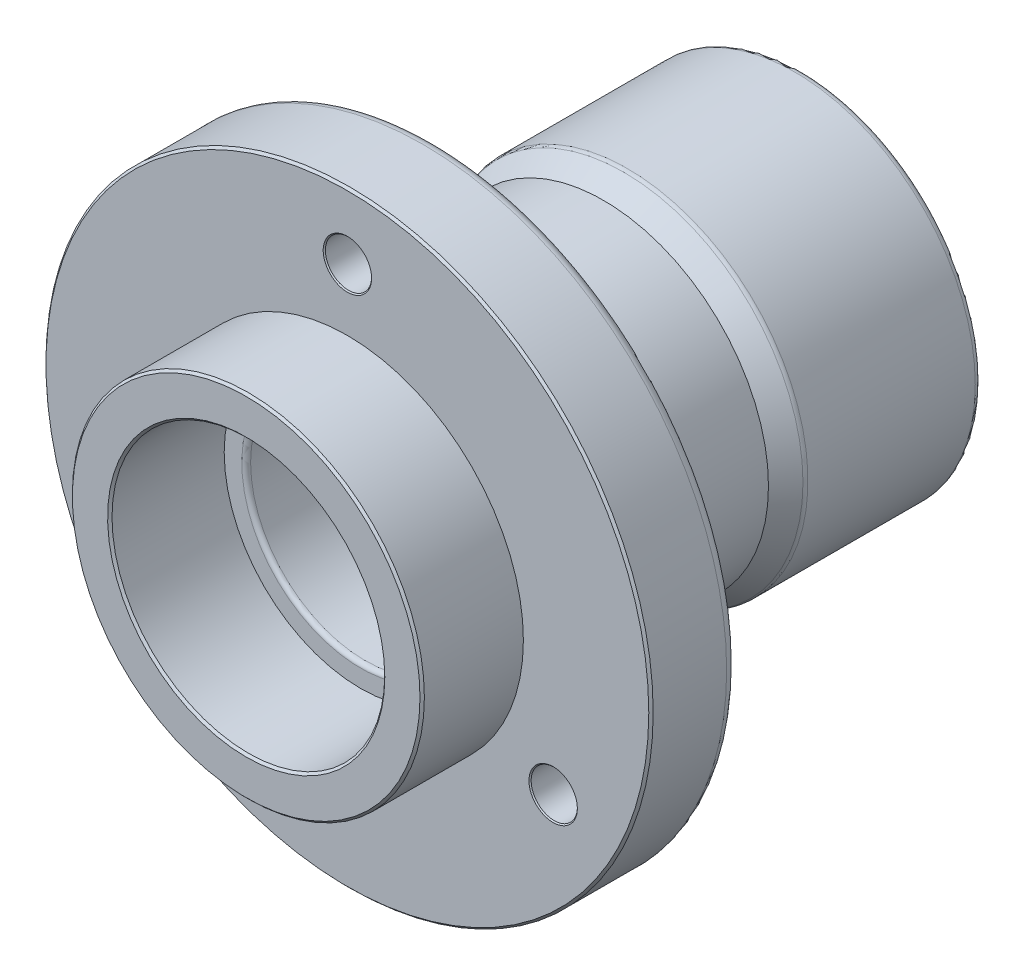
ISO-10303-21;
HEADER;
FILE_DESCRIPTION(('STEP AP214'),'2;1');
FILE_NAME('part.step','',(''),(''),'','','');
FILE_SCHEMA(('AUTOMOTIVE_DESIGN { 1 0 10303 214 1 1 1 1 }'));
ENDSEC;
DATA;
#1=APPLICATION_CONTEXT('core data for automotive mechanical design processes');
#2=APPLICATION_PROTOCOL_DEFINITION('international standard','automotive_design',2000,#1);
#3=PRODUCT_CONTEXT('',#1,'mechanical');
#4=PRODUCT('Part','Part','',(#3));
#5=PRODUCT_RELATED_PRODUCT_CATEGORY('part','',(#4));
#6=PRODUCT_DEFINITION_FORMATION('','',#4);
#7=PRODUCT_DEFINITION_CONTEXT('part definition',#1,'design');
#8=PRODUCT_DEFINITION('design','',#6,#7);
#9=PRODUCT_DEFINITION_SHAPE('','',#8);
#10=(LENGTH_UNIT() NAMED_UNIT(*) SI_UNIT(.MILLI.,.METRE.));
#11=(NAMED_UNIT(*) PLANE_ANGLE_UNIT() SI_UNIT($,.RADIAN.));
#12=(NAMED_UNIT(*) SI_UNIT($,.STERADIAN.) SOLID_ANGLE_UNIT());
#13=UNCERTAINTY_MEASURE_WITH_UNIT(LENGTH_MEASURE(1.E-05),#10,'distance_accuracy_value','');
#14=(GEOMETRIC_REPRESENTATION_CONTEXT(3) GLOBAL_UNCERTAINTY_ASSIGNED_CONTEXT((#13)) GLOBAL_UNIT_ASSIGNED_CONTEXT((#10,
#11,#12)) REPRESENTATION_CONTEXT('',''));
#15=CARTESIAN_POINT('',(0.,0.,0.));
#16=DIRECTION('',(0.,0.,1.));
#17=DIRECTION('',(1.,0.,0.));
#18=AXIS2_PLACEMENT_3D('',#15,#16,#17);
#19=CARTESIAN_POINT('',(0.,0.,-26.1710302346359));
#20=DIRECTION('',(0.,0.,-1.));
#21=DIRECTION('',(0.,1.,0.));
#22=AXIS2_PLACEMENT_3D('',#19,#20,#21);
#23=CYLINDRICAL_SURFACE('',#22,31.);
#24=CARTESIAN_POINT('',(0.,0.,12.));
#25=DIRECTION('',(0.,0.,-1.));
#26=DIRECTION('',(0.,1.,0.));
#27=AXIS2_PLACEMENT_3D('',#24,#25,#26);
#28=CIRCLE('',#27,31.);
#29=CARTESIAN_POINT('',(0.,31.,12.));
#30=VERTEX_POINT('',#29);
#31=EDGE_CURVE('E66',#30,#30,#28,.T.);
#32=ORIENTED_EDGE('',*,*,#31,.F.);
#33=EDGE_LOOP('',(#32));
#34=FACE_BOUND('',#33,.T.);
#35=CARTESIAN_POINT('',(0.,0.,10.));
#36=DIRECTION('',(0.,0.,-1.));
#37=DIRECTION('',(-1.,0.,0.));
#38=AXIS2_PLACEMENT_3D('',#35,#36,#37);
#39=CIRCLE('',#38,31.);
#40=CARTESIAN_POINT('',(-31.,0.,10.));
#41=VERTEX_POINT('',#40);
#42=EDGE_CURVE('E63',#41,#41,#39,.F.);
#43=ORIENTED_EDGE('',*,*,#42,.F.);
#44=EDGE_LOOP('',(#43));
#45=FACE_BOUND('',#44,.T.);
#46=ADVANCED_FACE('F30',(#34,#45),#23,.F.);
#47=CARTESIAN_POINT('',(0.,0.,31.));
#48=DIRECTION('',(0.,0.,-1.));
#49=DIRECTION('',(0.,1.,0.));
#50=AXIS2_PLACEMENT_3D('',#47,#48,#49);
#51=CIRCLE('',#50,31.);
#52=CARTESIAN_POINT('',(0.,31.,31.));
#53=VERTEX_POINT('',#52);
#54=EDGE_CURVE('E151',#53,#53,#51,.T.);
#55=ORIENTED_EDGE('',*,*,#54,.F.);
#56=EDGE_LOOP('',(#55));
#57=FACE_BOUND('',#56,.T.);
#58=CARTESIAN_POINT('',(0.,0.,14.15));
#59=DIRECTION('',(0.,0.,-1.));
#60=DIRECTION('',(0.,1.,0.));
#61=AXIS2_PLACEMENT_3D('',#58,#59,#60);
#62=CIRCLE('',#61,31.);
#63=CARTESIAN_POINT('',(0.,31.,14.15));
#64=VERTEX_POINT('',#63);
#65=EDGE_CURVE('E154',#64,#64,#62,.T.);
#66=ORIENTED_EDGE('',*,*,#65,.T.);
#67=EDGE_LOOP('',(#66));
#68=FACE_BOUND('',#67,.T.);
#69=ADVANCED_FACE('F193',(#57,#68),#23,.F.);
#70=CARTESIAN_POINT('',(0.,0.,103.2));
#71=DIRECTION('',(0.,0.,1.));
#72=DIRECTION('',(1.,0.,0.));
#73=AXIS2_PLACEMENT_3D('',#70,#71,#72);
#74=PLANE('',#73);
#75=CARTESIAN_POINT('',(0.,0.,103.2));
#76=DIRECTION('',(0.,0.,1.));
#77=DIRECTION('',(1.,0.,0.));
#78=AXIS2_PLACEMENT_3D('',#75,#76,#77);
#79=CIRCLE('',#78,68.5);
#80=CARTESIAN_POINT('',(68.5,0.,103.2));
#81=VERTEX_POINT('',#80);
#82=EDGE_CURVE('E37',#81,#81,#79,.T.);
#83=ORIENTED_EDGE('',*,*,#82,.T.);
#84=EDGE_LOOP('',(#83));
#85=FACE_BOUND('',#84,.T.);
#86=CARTESIAN_POINT('',(-46.7653718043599,-26.9999999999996,103.2));
#87=DIRECTION('',(0.,0.,1.));
#88=DIRECTION('',(1.,0.,0.));
#89=AXIS2_PLACEMENT_3D('',#86,#87,#88);
#90=CIRCLE('',#89,5.50000000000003);
#91=CARTESIAN_POINT('',(-41.2653718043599,-26.9999999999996,103.2));
#92=VERTEX_POINT('',#91);
#93=EDGE_CURVE('E97',#92,#92,#90,.F.);
#94=ORIENTED_EDGE('',*,*,#93,.T.);
#95=EDGE_LOOP('',(#94));
#96=FACE_BOUND('',#95,.T.);
#97=CARTESIAN_POINT('',(46.7653718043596,-27.0000000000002,103.2));
#98=DIRECTION('',(0.,0.,1.));
#99=DIRECTION('',(1.,0.,0.));
#100=AXIS2_PLACEMENT_3D('',#97,#98,#99);
#101=CIRCLE('',#100,5.50000000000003);
#102=CARTESIAN_POINT('',(52.2653718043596,-27.0000000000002,103.2));
#103=VERTEX_POINT('',#102);
#104=EDGE_CURVE('E109',#103,#103,#101,.F.);
#105=ORIENTED_EDGE('',*,*,#104,.T.);
#106=EDGE_LOOP('',(#105));
#107=FACE_BOUND('',#106,.T.);
#108=CARTESIAN_POINT('',(0.,54.,103.2));
#109=DIRECTION('',(0.,0.,1.));
#110=DIRECTION('',(1.,0.,0.));
#111=AXIS2_PLACEMENT_3D('',#108,#109,#110);
#112=CIRCLE('',#111,5.49999999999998);
#113=CARTESIAN_POINT('',(5.49999999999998,54.,103.2));
#114=VERTEX_POINT('',#113);
#115=EDGE_CURVE('E121',#114,#114,#112,.F.);
#116=ORIENTED_EDGE('',*,*,#115,.T.);
#117=EDGE_LOOP('',(#116));
#118=FACE_BOUND('',#117,.T.);
#119=CARTESIAN_POINT('',(0.,0.,103.2));
#120=DIRECTION('',(0.,0.,1.));
#121=DIRECTION('',(1.,0.,0.));
#122=AXIS2_PLACEMENT_3D('',#119,#120,#121);
#123=CIRCLE('',#122,40.);
#124=CARTESIAN_POINT('',(40.,0.,103.2));
#125=VERTEX_POINT('',#124);
#126=EDGE_CURVE('E145',#125,#125,#123,.T.);
#127=ORIENTED_EDGE('',*,*,#126,.F.);
#128=EDGE_LOOP('',(#127));
#129=FACE_BOUND('',#128,.T.);
#130=ADVANCED_FACE('F199',(#85,#96,#107,#118,#129),#74,.T.);
#131=CARTESIAN_POINT('',(0.,0.,83.5));
#132=DIRECTION('',(0.,0.,1.));
#133=DIRECTION('',(1.,0.,0.));
#134=AXIS2_PLACEMENT_3D('',#131,#132,#133);
#135=PLANE('',#134);
#136=CARTESIAN_POINT('',(0.,0.,83.5));
#137=DIRECTION('',(0.,0.,1.));
#138=DIRECTION('',(1.,0.,0.));
#139=AXIS2_PLACEMENT_3D('',#136,#137,#138);
#140=CIRCLE('',#139,66.5);
#141=CARTESIAN_POINT('',(66.5,0.,83.5));
#142=VERTEX_POINT('',#141);
#143=EDGE_CURVE('E62',#142,#142,#140,.F.);
#144=ORIENTED_EDGE('',*,*,#143,.T.);
#145=EDGE_LOOP('',(#144));
#146=FACE_BOUND('',#145,.T.);
#147=CARTESIAN_POINT('',(-46.7653718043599,-26.9999999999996,83.5));
#148=DIRECTION('',(0.,0.,1.));
#149=DIRECTION('',(1.,0.,0.));
#150=AXIS2_PLACEMENT_3D('',#147,#148,#149);
#151=CIRCLE('',#150,5.50000000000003);
#152=CARTESIAN_POINT('',(-41.2653718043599,-26.9999999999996,83.5));
#153=VERTEX_POINT('',#152);
#154=EDGE_CURVE('E106',#153,#153,#151,.T.);
#155=ORIENTED_EDGE('',*,*,#154,.T.);
#156=EDGE_LOOP('',(#155));
#157=FACE_BOUND('',#156,.T.);
#158=CARTESIAN_POINT('',(46.7653718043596,-27.0000000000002,83.5));
#159=DIRECTION('',(0.,0.,1.));
#160=DIRECTION('',(1.,0.,0.));
#161=AXIS2_PLACEMENT_3D('',#158,#159,#160);
#162=CIRCLE('',#161,5.49999999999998);
#163=CARTESIAN_POINT('',(52.2653718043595,-27.0000000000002,83.5));
#164=VERTEX_POINT('',#163);
#165=EDGE_CURVE('E118',#164,#164,#162,.T.);
#166=ORIENTED_EDGE('',*,*,#165,.T.);
#167=EDGE_LOOP('',(#166));
#168=FACE_BOUND('',#167,.T.);
#169=CARTESIAN_POINT('',(0.,54.,83.5));
#170=DIRECTION('',(0.,0.,1.));
#171=DIRECTION('',(1.,0.,0.));
#172=AXIS2_PLACEMENT_3D('',#169,#170,#171);
#173=CIRCLE('',#172,5.49999999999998);
#174=CARTESIAN_POINT('',(5.49999999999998,54.,83.5));
#175=VERTEX_POINT('',#174);
#176=EDGE_CURVE('E130',#175,#175,#173,.T.);
#177=ORIENTED_EDGE('',*,*,#176,.T.);
#178=EDGE_LOOP('',(#177));
#179=FACE_BOUND('',#178,.T.);
#180=CARTESIAN_POINT('',(0.,0.,83.5));
#181=DIRECTION('',(0.,0.,1.));
#182=DIRECTION('',(1.,0.,0.));
#183=AXIS2_PLACEMENT_3D('',#180,#181,#182);
#184=CIRCLE('',#183,43.5);
#185=CARTESIAN_POINT('',(43.5,0.,83.5));
#186=VERTEX_POINT('',#185);
#187=EDGE_CURVE('E142',#186,#186,#184,.F.);
#188=ORIENTED_EDGE('',*,*,#187,.F.);
#189=EDGE_LOOP('',(#188));
#190=FACE_BOUND('',#189,.T.);
#191=ADVANCED_FACE('F234',(#146,#157,#168,#179,#190),#135,.F.);
#192=CARTESIAN_POINT('',(0.,0.,40.));
#193=DIRECTION('',(0.,0.,-1.));
#194=DIRECTION('',(-1.,0.,0.));
#195=AXIS2_PLACEMENT_3D('',#192,#193,#194);
#196=CYLINDRICAL_SURFACE('',#195,41.);
#197=CARTESIAN_POINT('',(0.,0.,39.5271666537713));
#198=DIRECTION('',(0.,0.,-1.));
#199=DIRECTION('',(-1.,0.,0.));
#200=AXIS2_PLACEMENT_3D('',#197,#198,#199);
#201=CIRCLE('',#200,41.);
#202=CARTESIAN_POINT('',(-41.,0.,39.5271666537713));
#203=VERTEX_POINT('',#202);
#204=EDGE_CURVE('E85',#203,#203,#201,.T.);
#205=ORIENTED_EDGE('',*,*,#204,.T.);
#206=EDGE_LOOP('',(#205));
#207=FACE_BOUND('',#206,.T.);
#208=CARTESIAN_POINT('',(0.,0.,1.50000000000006));
#209=DIRECTION('',(0.,0.,1.));
#210=DIRECTION('',(1.,0.,0.));
#211=AXIS2_PLACEMENT_3D('',#208,#209,#210);
#212=CIRCLE('',#211,41.);
#213=CARTESIAN_POINT('',(41.,0.,1.50000000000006));
#214=VERTEX_POINT('',#213);
#215=EDGE_CURVE('E94',#214,#214,#212,.T.);
#216=ORIENTED_EDGE('',*,*,#215,.T.);
#217=EDGE_LOOP('',(#216));
#218=FACE_BOUND('',#217,.T.);
#219=ADVANCED_FACE('F237',(#207,#218),#196,.T.);
#220=CARTESIAN_POINT('',(0.,0.,0.));
#221=DIRECTION('',(0.,0.,1.));
#222=DIRECTION('',(1.,0.,0.));
#223=AXIS2_PLACEMENT_3D('',#220,#221,#222);
#224=PLANE('',#223);
#225=CARTESIAN_POINT('',(0.,0.,0.));
#226=DIRECTION('',(0.,0.,1.));
#227=DIRECTION('',(1.,0.,0.));
#228=AXIS2_PLACEMENT_3D('',#225,#226,#227);
#229=CIRCLE('',#228,36.5);
#230=CARTESIAN_POINT('',(36.5,0.,0.));
#231=VERTEX_POINT('',#230);
#232=EDGE_CURVE('E56',#231,#231,#229,.T.);
#233=ORIENTED_EDGE('',*,*,#232,.T.);
#234=EDGE_LOOP('',(#233));
#235=FACE_BOUND('',#234,.T.);
#236=CARTESIAN_POINT('',(0.,0.,0.));
#237=DIRECTION('',(0.,0.,1.));
#238=DIRECTION('',(1.,0.,0.));
#239=AXIS2_PLACEMENT_3D('',#236,#237,#238);
#240=CIRCLE('',#239,39.5);
#241=CARTESIAN_POINT('',(39.5,0.,0.));
#242=VERTEX_POINT('',#241);
#243=EDGE_CURVE('E91',#242,#242,#240,.F.);
#244=ORIENTED_EDGE('',*,*,#243,.T.);
#245=EDGE_LOOP('',(#244));
#246=FACE_BOUND('',#245,.T.);
#247=ADVANCED_FACE('F256',(#235,#246),#224,.F.);
#248=CARTESIAN_POINT('',(0.,0.,40.));
#249=DIRECTION('',(0.,0.,-1.));
#250=DIRECTION('',(-1.,0.,0.));
#251=AXIS2_PLACEMENT_3D('',#248,#249,#250);
#252=CONICAL_SURFACE('',#251,41.,0.610725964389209);
#253=CARTESIAN_POINT('',(0.,0.,40.3873601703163));
#254=DIRECTION('',(0.,0.,-1.));
#255=DIRECTION('',(-1.,0.,0.));
#256=AXIS2_PLACEMENT_3D('',#253,#254,#255);
#257=CIRCLE('',#256,40.7288478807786);
#258=CARTESIAN_POINT('',(-40.7288478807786,0.,40.3873601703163));
#259=VERTEX_POINT('',#258);
#260=EDGE_CURVE('E88',#259,#259,#257,.F.);
#261=ORIENTED_EDGE('',*,*,#260,.T.);
#262=EDGE_LOOP('',(#261));
#263=FACE_BOUND('',#262,.T.);
#264=CARTESIAN_POINT('',(0.,0.,45.));
#265=DIRECTION('',(0.,0.,1.));
#266=DIRECTION('',(1.,0.,0.));
#267=AXIS2_PLACEMENT_3D('',#264,#265,#266);
#268=CIRCLE('',#267,37.5);
#269=CARTESIAN_POINT('',(37.5,0.,45.));
#270=VERTEX_POINT('',#269);
#271=EDGE_CURVE('E134',#270,#270,#268,.T.);
#272=ORIENTED_EDGE('',*,*,#271,.F.);
#273=EDGE_LOOP('',(#272));
#274=FACE_BOUND('',#273,.T.);
#275=ADVANCED_FACE('F252',(#263,#274),#252,.T.);
#276=CARTESIAN_POINT('',(0.,0.,80.));
#277=DIRECTION('',(0.,0.,-1.));
#278=DIRECTION('',(-1.,0.,0.));
#279=AXIS2_PLACEMENT_3D('',#276,#277,#278);
#280=CYLINDRICAL_SURFACE('',#279,37.5);
#281=CARTESIAN_POINT('',(0.,0.,80.));
#282=DIRECTION('',(0.,0.,1.));
#283=DIRECTION('',(1.,0.,0.));
#284=AXIS2_PLACEMENT_3D('',#281,#282,#283);
#285=CIRCLE('',#284,37.5);
#286=CARTESIAN_POINT('',(37.5,0.,80.));
#287=VERTEX_POINT('',#286);
#288=EDGE_CURVE('E133',#287,#287,#285,.T.);
#289=ORIENTED_EDGE('',*,*,#288,.F.);
#290=EDGE_LOOP('',(#289));
#291=FACE_BOUND('',#290,.T.);
#292=ORIENTED_EDGE('',*,*,#271,.T.);
#293=EDGE_LOOP('',(#292));
#294=FACE_BOUND('',#293,.T.);
#295=ADVANCED_FACE('F245',(#291,#294),#280,.T.);
#296=CARTESIAN_POINT('',(-40.5,0.,80.));
#297=DIRECTION('',(0.,0.,-1.));
#298=DIRECTION('',(-1.,0.,0.));
#299=AXIS2_PLACEMENT_3D('',#296,#297,#298);
#300=PLANE('',#299);
#301=CARTESIAN_POINT('',(0.,0.,80.));
#302=DIRECTION('',(0.,0.,-1.));
#303=DIRECTION('',(-1.,0.,0.));
#304=AXIS2_PLACEMENT_3D('',#301,#302,#303);
#305=CIRCLE('',#304,40.5);
#306=CARTESIAN_POINT('',(-40.5,0.,80.));
#307=VERTEX_POINT('',#306);
#308=EDGE_CURVE('E137',#307,#307,#305,.T.);
#309=ORIENTED_EDGE('',*,*,#308,.T.);
#310=EDGE_LOOP('',(#309));
#311=FACE_BOUND('',#310,.T.);
#312=ORIENTED_EDGE('',*,*,#288,.T.);
#313=EDGE_LOOP('',(#312));
#314=FACE_BOUND('',#313,.T.);
#315=ADVANCED_FACE('F242',(#311,#314),#300,.T.);
#316=CARTESIAN_POINT('',(0.,0.,80.));
#317=DIRECTION('',(0.,0.,1.));
#318=DIRECTION('',(1.,0.,0.));
#319=AXIS2_PLACEMENT_3D('',#316,#317,#318);
#320=CONICAL_SURFACE('',#319,40.5,0.708626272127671);
#321=ORIENTED_EDGE('',*,*,#187,.T.);
#322=EDGE_LOOP('',(#321));
#323=FACE_BOUND('',#322,.T.);
#324=ORIENTED_EDGE('',*,*,#308,.F.);
#325=EDGE_LOOP('',(#324));
#326=FACE_BOUND('',#325,.T.);
#327=ADVANCED_FACE('F241',(#323,#326),#320,.T.);
#328=CARTESIAN_POINT('',(0.,0.,103.2));
#329=DIRECTION('',(0.,0.,-1.));
#330=DIRECTION('',(-1.,0.,0.));
#331=AXIS2_PLACEMENT_3D('',#328,#329,#330);
#332=CYLINDRICAL_SURFACE('',#331,69.);
#333=CARTESIAN_POINT('',(0.,0.,102.7));
#334=DIRECTION('',(0.,0.,1.));
#335=DIRECTION('',(1.,0.,0.));
#336=AXIS2_PLACEMENT_3D('',#333,#334,#335);
#337=CIRCLE('',#336,69.);
#338=CARTESIAN_POINT('',(69.,0.,102.7));
#339=VERTEX_POINT('',#338);
#340=EDGE_CURVE('E10',#339,#339,#337,.F.);
#341=ORIENTED_EDGE('',*,*,#340,.T.);
#342=EDGE_LOOP('',(#341));
#343=FACE_BOUND('',#342,.T.);
#344=CARTESIAN_POINT('',(0.,0.,86.));
#345=DIRECTION('',(0.,0.,1.));
#346=DIRECTION('',(1.,0.,0.));
#347=AXIS2_PLACEMENT_3D('',#344,#345,#346);
#348=CIRCLE('',#347,69.);
#349=CARTESIAN_POINT('',(69.,0.,86.));
#350=VERTEX_POINT('',#349);
#351=EDGE_CURVE('E70',#350,#350,#348,.T.);
#352=ORIENTED_EDGE('',*,*,#351,.T.);
#353=EDGE_LOOP('',(#352));
#354=FACE_BOUND('',#353,.T.);
#355=ADVANCED_FACE('F230',(#343,#354),#332,.T.);
#356=CARTESIAN_POINT('',(0.,0.,126.2));
#357=DIRECTION('',(0.,0.,-1.));
#358=DIRECTION('',(-1.,0.,0.));
#359=AXIS2_PLACEMENT_3D('',#356,#357,#358);
#360=CYLINDRICAL_SURFACE('',#359,40.);
#361=CARTESIAN_POINT('',(0.,0.,125.7));
#362=DIRECTION('',(0.,0.,1.));
#363=DIRECTION('',(1.,0.,0.));
#364=AXIS2_PLACEMENT_3D('',#361,#362,#363);
#365=CIRCLE('',#364,40.);
#366=CARTESIAN_POINT('',(40.,0.,125.7));
#367=VERTEX_POINT('',#366);
#368=EDGE_CURVE('E41',#367,#367,#365,.F.);
#369=ORIENTED_EDGE('',*,*,#368,.T.);
#370=EDGE_LOOP('',(#369));
#371=FACE_BOUND('',#370,.T.);
#372=ORIENTED_EDGE('',*,*,#126,.T.);
#373=EDGE_LOOP('',(#372));
#374=FACE_BOUND('',#373,.T.);
#375=ADVANCED_FACE('F226',(#371,#374),#360,.T.);
#376=CARTESIAN_POINT('',(0.,0.,126.2));
#377=DIRECTION('',(0.,0.,1.));
#378=DIRECTION('',(1.,0.,0.));
#379=AXIS2_PLACEMENT_3D('',#376,#377,#378);
#380=PLANE('',#379);
#381=CARTESIAN_POINT('',(0.,0.,126.2));
#382=DIRECTION('',(0.,0.,1.));
#383=DIRECTION('',(1.,0.,0.));
#384=AXIS2_PLACEMENT_3D('',#381,#382,#383);
#385=CIRCLE('',#384,31.5);
#386=CARTESIAN_POINT('',(31.5,0.,126.2));
#387=VERTEX_POINT('',#386);
#388=EDGE_CURVE('E50',#387,#387,#385,.F.);
#389=ORIENTED_EDGE('',*,*,#388,.T.);
#390=EDGE_LOOP('',(#389));
#391=FACE_BOUND('',#390,.T.);
#392=CARTESIAN_POINT('',(0.,0.,126.2));
#393=DIRECTION('',(0.,0.,1.));
#394=DIRECTION('',(1.,0.,0.));
#395=AXIS2_PLACEMENT_3D('',#392,#393,#394);
#396=CIRCLE('',#395,39.5);
#397=CARTESIAN_POINT('',(39.5,0.,126.2));
#398=VERTEX_POINT('',#397);
#399=EDGE_CURVE('E53',#398,#398,#396,.T.);
#400=ORIENTED_EDGE('',*,*,#399,.T.);
#401=EDGE_LOOP('',(#400));
#402=FACE_BOUND('',#401,.T.);
#403=ADVANCED_FACE('F222',(#391,#402),#380,.T.);
#404=CARTESIAN_POINT('',(0.,0.,-26.1710302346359));
#405=DIRECTION('',(0.,0.,-1.));
#406=DIRECTION('',(0.,1.,0.));
#407=AXIS2_PLACEMENT_3D('',#404,#405,#406);
#408=CYLINDRICAL_SURFACE('',#407,31.);
#409=CARTESIAN_POINT('',(0.,0.,125.7));
#410=DIRECTION('',(0.,0.,1.));
#411=DIRECTION('',(0.,-1.,0.));
#412=AXIS2_PLACEMENT_3D('',#409,#410,#411);
#413=CIRCLE('',#412,31.);
#414=CARTESIAN_POINT('',(0.,-31.,125.7));
#415=VERTEX_POINT('',#414);
#416=EDGE_CURVE('E45',#415,#415,#413,.T.);
#417=ORIENTED_EDGE('',*,*,#416,.T.);
#418=EDGE_LOOP('',(#417));
#419=FACE_BOUND('',#418,.T.);
#420=CARTESIAN_POINT('',(0.,0.,100.2));
#421=DIRECTION('',(0.,0.,-1.));
#422=DIRECTION('',(0.,1.,0.));
#423=AXIS2_PLACEMENT_3D('',#420,#421,#422);
#424=CIRCLE('',#423,31.);
#425=CARTESIAN_POINT('',(0.,30.9999999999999,100.2));
#426=VERTEX_POINT('',#425);
#427=EDGE_CURVE('E148',#426,#426,#424,.T.);
#428=ORIENTED_EDGE('',*,*,#427,.T.);
#429=EDGE_LOOP('',(#428));
#430=FACE_BOUND('',#429,.T.);
#431=ADVANCED_FACE('F218',(#419,#430),#408,.F.);
#432=CARTESIAN_POINT('',(0.,30.9999999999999,100.2));
#433=DIRECTION('',(0.,0.,-1.));
#434=DIRECTION('',(0.,1.,0.));
#435=AXIS2_PLACEMENT_3D('',#432,#433,#434);
#436=PLANE('',#435);
#437=CARTESIAN_POINT('',(0.,0.,100.2));
#438=DIRECTION('',(0.,0.,-1.));
#439=DIRECTION('',(0.,1.,0.));
#440=AXIS2_PLACEMENT_3D('',#437,#438,#439);
#441=CIRCLE('',#440,27.);
#442=CARTESIAN_POINT('',(0.,27.,100.2));
#443=VERTEX_POINT('',#442);
#444=EDGE_CURVE('E82',#443,#443,#441,.T.);
#445=ORIENTED_EDGE('',*,*,#444,.T.);
#446=EDGE_LOOP('',(#445));
#447=FACE_BOUND('',#446,.T.);
#448=ORIENTED_EDGE('',*,*,#427,.F.);
#449=EDGE_LOOP('',(#448));
#450=FACE_BOUND('',#449,.T.);
#451=ADVANCED_FACE('F214',(#447,#450),#436,.F.);
#452=CARTESIAN_POINT('',(0.,0.,-26.1710302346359));
#453=DIRECTION('',(0.,0.,-1.));
#454=DIRECTION('',(0.,1.,0.));
#455=AXIS2_PLACEMENT_3D('',#452,#453,#454);
#456=CYLINDRICAL_SURFACE('',#455,26.);
#457=CARTESIAN_POINT('',(0.,0.,99.2));
#458=DIRECTION('',(0.,0.,-1.));
#459=DIRECTION('',(0.,1.,0.));
#460=AXIS2_PLACEMENT_3D('',#457,#458,#459);
#461=CIRCLE('',#460,26.);
#462=CARTESIAN_POINT('',(0.,26.,99.2));
#463=VERTEX_POINT('',#462);
#464=EDGE_CURVE('E76',#463,#463,#461,.F.);
#465=ORIENTED_EDGE('',*,*,#464,.T.);
#466=EDGE_LOOP('',(#465));
#467=FACE_BOUND('',#466,.T.);
#468=CARTESIAN_POINT('',(0.,0.,32.));
#469=DIRECTION('',(0.,0.,1.));
#470=DIRECTION('',(0.,-1.,0.));
#471=AXIS2_PLACEMENT_3D('',#468,#469,#470);
#472=CIRCLE('',#471,26.);
#473=CARTESIAN_POINT('',(0.,-26.,32.));
#474=VERTEX_POINT('',#473);
#475=EDGE_CURVE('E79',#474,#474,#472,.F.);
#476=ORIENTED_EDGE('',*,*,#475,.T.);
#477=EDGE_LOOP('',(#476));
#478=FACE_BOUND('',#477,.T.);
#479=ADVANCED_FACE('F210',(#467,#478),#456,.F.);
#480=CARTESIAN_POINT('',(0.,26.,31.));
#481=DIRECTION('',(0.,0.,1.));
#482=DIRECTION('',(0.,-1.,0.));
#483=AXIS2_PLACEMENT_3D('',#480,#481,#482);
#484=PLANE('',#483);
#485=CARTESIAN_POINT('',(0.,0.,31.));
#486=DIRECTION('',(0.,0.,1.));
#487=DIRECTION('',(0.,-1.,0.));
#488=AXIS2_PLACEMENT_3D('',#485,#486,#487);
#489=CIRCLE('',#488,27.);
#490=CARTESIAN_POINT('',(0.,-27.,31.));
#491=VERTEX_POINT('',#490);
#492=EDGE_CURVE('E73',#491,#491,#489,.T.);
#493=ORIENTED_EDGE('',*,*,#492,.T.);
#494=EDGE_LOOP('',(#493));
#495=FACE_BOUND('',#494,.T.);
#496=ORIENTED_EDGE('',*,*,#54,.T.);
#497=EDGE_LOOP('',(#496));
#498=FACE_BOUND('',#497,.T.);
#499=ADVANCED_FACE('F207',(#495,#498),#484,.F.);
#500=CARTESIAN_POINT('',(0.,54.,126.2));
#501=DIRECTION('',(0.,0.,-1.));
#502=DIRECTION('',(-1.,0.,0.));
#503=AXIS2_PLACEMENT_3D('',#500,#501,#502);
#504=CYLINDRICAL_SURFACE('',#503,5.25);
#505=CARTESIAN_POINT('',(0.,54.,83.75));
#506=DIRECTION('',(0.,0.,1.));
#507=DIRECTION('',(1.,0.,0.));
#508=AXIS2_PLACEMENT_3D('',#505,#506,#507);
#509=CIRCLE('',#508,5.25);
#510=CARTESIAN_POINT('',(5.25,54.,83.75));
#511=VERTEX_POINT('',#510);
#512=EDGE_CURVE('E124',#511,#511,#509,.F.);
#513=ORIENTED_EDGE('',*,*,#512,.T.);
#514=EDGE_LOOP('',(#513));
#515=FACE_BOUND('',#514,.T.);
#516=CARTESIAN_POINT('',(0.,54.,102.95));
#517=DIRECTION('',(0.,0.,1.));
#518=DIRECTION('',(1.,0.,0.));
#519=AXIS2_PLACEMENT_3D('',#516,#517,#518);
#520=CIRCLE('',#519,5.25);
#521=CARTESIAN_POINT('',(5.25,54.,102.95));
#522=VERTEX_POINT('',#521);
#523=EDGE_CURVE('E127',#522,#522,#520,.T.);
#524=ORIENTED_EDGE('',*,*,#523,.T.);
#525=EDGE_LOOP('',(#524));
#526=FACE_BOUND('',#525,.T.);
#527=ADVANCED_FACE('F205',(#515,#526),#504,.F.);
#528=CARTESIAN_POINT('',(0.,54.,83.5));
#529=DIRECTION('',(0.,0.,-1.));
#530=DIRECTION('',(-1.,0.,0.));
#531=AXIS2_PLACEMENT_3D('',#528,#529,#530);
#532=CONICAL_SURFACE('',#531,5.49999999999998,0.785398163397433);
#533=ORIENTED_EDGE('',*,*,#512,.F.);
#534=EDGE_LOOP('',(#533));
#535=FACE_BOUND('',#534,.T.);
#536=ORIENTED_EDGE('',*,*,#176,.F.);
#537=EDGE_LOOP('',(#536));
#538=FACE_BOUND('',#537,.T.);
#539=ADVANCED_FACE('F264',(#535,#538),#532,.F.);
#540=CARTESIAN_POINT('',(0.,54.,103.2));
#541=DIRECTION('',(0.,0.,1.));
#542=DIRECTION('',(1.,0.,0.));
#543=AXIS2_PLACEMENT_3D('',#540,#541,#542);
#544=CONICAL_SURFACE('',#543,5.49999999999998,0.785398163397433);
#545=ORIENTED_EDGE('',*,*,#523,.F.);
#546=EDGE_LOOP('',(#545));
#547=FACE_BOUND('',#546,.T.);
#548=ORIENTED_EDGE('',*,*,#115,.F.);
#549=EDGE_LOOP('',(#548));
#550=FACE_BOUND('',#549,.T.);
#551=ADVANCED_FACE('F267',(#547,#550),#544,.F.);
#552=CARTESIAN_POINT('',(46.7653718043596,-27.0000000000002,126.2));
#553=DIRECTION('',(0.,0.,-1.));
#554=DIRECTION('',(-1.,0.,0.));
#555=AXIS2_PLACEMENT_3D('',#552,#553,#554);
#556=CYLINDRICAL_SURFACE('',#555,5.25);
#557=CARTESIAN_POINT('',(46.7653718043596,-27.0000000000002,83.75));
#558=DIRECTION('',(0.,0.,1.));
#559=DIRECTION('',(1.,0.,0.));
#560=AXIS2_PLACEMENT_3D('',#557,#558,#559);
#561=CIRCLE('',#560,5.25);
#562=CARTESIAN_POINT('',(52.0153718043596,-27.0000000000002,83.75));
#563=VERTEX_POINT('',#562);
#564=EDGE_CURVE('E112',#563,#563,#561,.F.);
#565=ORIENTED_EDGE('',*,*,#564,.T.);
#566=EDGE_LOOP('',(#565));
#567=FACE_BOUND('',#566,.T.);
#568=CARTESIAN_POINT('',(46.7653718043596,-27.0000000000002,102.95));
#569=DIRECTION('',(0.,0.,1.));
#570=DIRECTION('',(1.,0.,0.));
#571=AXIS2_PLACEMENT_3D('',#568,#569,#570);
#572=CIRCLE('',#571,5.25);
#573=CARTESIAN_POINT('',(52.0153718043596,-27.0000000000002,102.95));
#574=VERTEX_POINT('',#573);
#575=EDGE_CURVE('E115',#574,#574,#572,.T.);
#576=ORIENTED_EDGE('',*,*,#575,.T.);
#577=EDGE_LOOP('',(#576));
#578=FACE_BOUND('',#577,.T.);
#579=ADVANCED_FACE('F271',(#567,#578),#556,.F.);
#580=CARTESIAN_POINT('',(-46.7653718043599,-26.9999999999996,126.2));
#581=DIRECTION('',(0.,0.,-1.));
#582=DIRECTION('',(-1.,0.,0.));
#583=AXIS2_PLACEMENT_3D('',#580,#581,#582);
#584=CYLINDRICAL_SURFACE('',#583,5.25);
#585=CARTESIAN_POINT('',(-46.7653718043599,-26.9999999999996,83.75));
#586=DIRECTION('',(0.,0.,1.));
#587=DIRECTION('',(1.,0.,0.));
#588=AXIS2_PLACEMENT_3D('',#585,#586,#587);
#589=CIRCLE('',#588,5.25);
#590=CARTESIAN_POINT('',(-41.5153718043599,-26.9999999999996,83.75));
#591=VERTEX_POINT('',#590);
#592=EDGE_CURVE('E100',#591,#591,#589,.F.);
#593=ORIENTED_EDGE('',*,*,#592,.T.);
#594=EDGE_LOOP('',(#593));
#595=FACE_BOUND('',#594,.T.);
#596=CARTESIAN_POINT('',(-46.7653718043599,-26.9999999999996,102.95));
#597=DIRECTION('',(0.,0.,1.));
#598=DIRECTION('',(1.,0.,0.));
#599=AXIS2_PLACEMENT_3D('',#596,#597,#598);
#600=CIRCLE('',#599,5.25);
#601=CARTESIAN_POINT('',(-41.5153718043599,-26.9999999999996,102.95));
#602=VERTEX_POINT('',#601);
#603=EDGE_CURVE('E103',#602,#602,#600,.T.);
#604=ORIENTED_EDGE('',*,*,#603,.T.);
#605=EDGE_LOOP('',(#604));
#606=FACE_BOUND('',#605,.T.);
#607=ADVANCED_FACE('F277',(#595,#606),#584,.F.);
#608=CARTESIAN_POINT('',(46.7653718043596,-27.0000000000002,83.5));
#609=DIRECTION('',(0.,0.,-1.));
#610=DIRECTION('',(-1.,0.,0.));
#611=AXIS2_PLACEMENT_3D('',#608,#609,#610);
#612=CONICAL_SURFACE('',#611,5.49999999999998,0.78539816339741);
#613=ORIENTED_EDGE('',*,*,#564,.F.);
#614=EDGE_LOOP('',(#613));
#615=FACE_BOUND('',#614,.T.);
#616=ORIENTED_EDGE('',*,*,#165,.F.);
#617=EDGE_LOOP('',(#616));
#618=FACE_BOUND('',#617,.T.);
#619=ADVANCED_FACE('F273',(#615,#618),#612,.F.);
#620=CARTESIAN_POINT('',(46.7653718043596,-27.0000000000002,103.2));
#621=DIRECTION('',(0.,0.,1.));
#622=DIRECTION('',(1.,0.,0.));
#623=AXIS2_PLACEMENT_3D('',#620,#621,#622);
#624=CONICAL_SURFACE('',#623,5.50000000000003,0.78539816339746);
#625=ORIENTED_EDGE('',*,*,#575,.F.);
#626=EDGE_LOOP('',(#625));
#627=FACE_BOUND('',#626,.T.);
#628=ORIENTED_EDGE('',*,*,#104,.F.);
#629=EDGE_LOOP('',(#628));
#630=FACE_BOUND('',#629,.T.);
#631=ADVANCED_FACE('F276',(#627,#630),#624,.F.);
#632=CARTESIAN_POINT('',(-46.7653718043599,-26.9999999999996,83.5));
#633=DIRECTION('',(0.,0.,-1.));
#634=DIRECTION('',(-1.,0.,0.));
#635=AXIS2_PLACEMENT_3D('',#632,#633,#634);
#636=CONICAL_SURFACE('',#635,5.50000000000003,0.785398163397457);
#637=ORIENTED_EDGE('',*,*,#592,.F.);
#638=EDGE_LOOP('',(#637));
#639=FACE_BOUND('',#638,.T.);
#640=ORIENTED_EDGE('',*,*,#154,.F.);
#641=EDGE_LOOP('',(#640));
#642=FACE_BOUND('',#641,.T.);
#643=ADVANCED_FACE('F281',(#639,#642),#636,.F.);
#644=CARTESIAN_POINT('',(-46.7653718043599,-26.9999999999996,103.2));
#645=DIRECTION('',(0.,0.,1.));
#646=DIRECTION('',(1.,0.,0.));
#647=AXIS2_PLACEMENT_3D('',#644,#645,#646);
#648=CONICAL_SURFACE('',#647,5.50000000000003,0.78539816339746);
#649=ORIENTED_EDGE('',*,*,#603,.F.);
#650=EDGE_LOOP('',(#649));
#651=FACE_BOUND('',#650,.T.);
#652=ORIENTED_EDGE('',*,*,#93,.F.);
#653=EDGE_LOOP('',(#652));
#654=FACE_BOUND('',#653,.T.);
#655=ADVANCED_FACE('F285',(#651,#654),#648,.F.);
#656=CARTESIAN_POINT('',(0.,0.,1.50000000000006));
#657=DIRECTION('',(0.,0.,1.));
#658=DIRECTION('',(1.,0.,0.));
#659=AXIS2_PLACEMENT_3D('',#656,#657,#658);
#660=TOROIDAL_SURFACE('',#659,39.5,1.5);
#661=ORIENTED_EDGE('',*,*,#243,.F.);
#662=EDGE_LOOP('',(#661));
#663=FACE_BOUND('',#662,.T.);
#664=ORIENTED_EDGE('',*,*,#215,.F.);
#665=EDGE_LOOP('',(#664));
#666=FACE_BOUND('',#665,.T.);
#667=ADVANCED_FACE('F289',(#663,#666),#660,.T.);
#668=CARTESIAN_POINT('',(0.,0.,39.5271666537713));
#669=DIRECTION('',(0.,0.,-1.));
#670=DIRECTION('',(-1.,0.,0.));
#671=AXIS2_PLACEMENT_3D('',#668,#669,#670);
#672=TOROIDAL_SURFACE('',#671,39.5,1.5);
#673=ORIENTED_EDGE('',*,*,#204,.F.);
#674=EDGE_LOOP('',(#673));
#675=FACE_BOUND('',#674,.T.);
#676=ORIENTED_EDGE('',*,*,#260,.F.);
#677=EDGE_LOOP('',(#676));
#678=FACE_BOUND('',#677,.T.);
#679=ADVANCED_FACE('F293',(#675,#678),#672,.T.);
#680=CARTESIAN_POINT('',(0.,0.,99.2));
#681=DIRECTION('',(0.,0.,-1.));
#682=DIRECTION('',(0.,1.,0.));
#683=AXIS2_PLACEMENT_3D('',#680,#681,#682);
#684=TOROIDAL_SURFACE('',#683,27.,1.);
#685=ORIENTED_EDGE('',*,*,#464,.F.);
#686=EDGE_LOOP('',(#685));
#687=FACE_BOUND('',#686,.T.);
#688=ORIENTED_EDGE('',*,*,#444,.F.);
#689=EDGE_LOOP('',(#688));
#690=FACE_BOUND('',#689,.T.);
#691=ADVANCED_FACE('F297',(#687,#690),#684,.T.);
#692=CARTESIAN_POINT('',(0.,0.,32.));
#693=DIRECTION('',(0.,0.,1.));
#694=DIRECTION('',(0.,-1.,0.));
#695=AXIS2_PLACEMENT_3D('',#692,#693,#694);
#696=TOROIDAL_SURFACE('',#695,27.,1.);
#697=ORIENTED_EDGE('',*,*,#492,.F.);
#698=EDGE_LOOP('',(#697));
#699=FACE_BOUND('',#698,.T.);
#700=ORIENTED_EDGE('',*,*,#475,.F.);
#701=EDGE_LOOP('',(#700));
#702=FACE_BOUND('',#701,.T.);
#703=ADVANCED_FACE('F301',(#699,#702),#696,.T.);
#704=CARTESIAN_POINT('',(0.,0.,86.));
#705=DIRECTION('',(0.,0.,1.));
#706=DIRECTION('',(1.,0.,0.));
#707=AXIS2_PLACEMENT_3D('',#704,#705,#706);
#708=TOROIDAL_SURFACE('',#707,66.5,2.5);
#709=ORIENTED_EDGE('',*,*,#143,.F.);
#710=EDGE_LOOP('',(#709));
#711=FACE_BOUND('',#710,.T.);
#712=ORIENTED_EDGE('',*,*,#351,.F.);
#713=EDGE_LOOP('',(#712));
#714=FACE_BOUND('',#713,.T.);
#715=ADVANCED_FACE('F305',(#711,#714),#708,.T.);
#716=CARTESIAN_POINT('',(0.,32.285,14.15));
#717=DIRECTION('',(0.,0.,-1.));
#718=DIRECTION('',(0.,1.,0.));
#719=AXIS2_PLACEMENT_3D('',#716,#717,#718);
#720=PLANE('',#719);
#721=CARTESIAN_POINT('',(0.,0.,14.15));
#722=DIRECTION('',(0.,0.,-1.));
#723=DIRECTION('',(0.,1.,0.));
#724=AXIS2_PLACEMENT_3D('',#721,#722,#723);
#725=CIRCLE('',#724,32.285);
#726=CARTESIAN_POINT('',(0.,32.285,14.15));
#727=VERTEX_POINT('',#726);
#728=EDGE_CURVE('E157',#727,#727,#725,.T.);
#729=ORIENTED_EDGE('',*,*,#728,.T.);
#730=EDGE_LOOP('',(#729));
#731=FACE_BOUND('',#730,.T.);
#732=ORIENTED_EDGE('',*,*,#65,.F.);
#733=EDGE_LOOP('',(#732));
#734=FACE_BOUND('',#733,.T.);
#735=ADVANCED_FACE('F308',(#731,#734),#720,.T.);
#736=CARTESIAN_POINT('',(0.,0.,13.935));
#737=DIRECTION('',(0.,0.,-1.));
#738=DIRECTION('',(0.,1.,0.));
#739=AXIS2_PLACEMENT_3D('',#736,#737,#738);
#740=TOROIDAL_SURFACE('',#739,32.285,0.215);
#741=CARTESIAN_POINT('',(0.,0.,13.935));
#742=DIRECTION('',(0.,0.,-1.));
#743=DIRECTION('',(0.,1.,0.));
#744=AXIS2_PLACEMENT_3D('',#741,#742,#743);
#745=CIRCLE('',#744,32.5);
#746=CARTESIAN_POINT('',(0.,32.5,13.935));
#747=VERTEX_POINT('',#746);
#748=EDGE_CURVE('E160',#747,#747,#745,.T.);
#749=ORIENTED_EDGE('',*,*,#748,.T.);
#750=EDGE_LOOP('',(#749));
#751=FACE_BOUND('',#750,.T.);
#752=ORIENTED_EDGE('',*,*,#728,.F.);
#753=EDGE_LOOP('',(#752));
#754=FACE_BOUND('',#753,.T.);
#755=ADVANCED_FACE('F370',(#751,#754),#740,.F.);
#756=CARTESIAN_POINT('',(0.,0.,23.5651271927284));
#757=DIRECTION('',(0.,0.,-1.));
#758=DIRECTION('',(0.,1.,0.));
#759=AXIS2_PLACEMENT_3D('',#756,#757,#758);
#760=CYLINDRICAL_SURFACE('',#759,32.5);
#761=CARTESIAN_POINT('',(0.,0.,12.215));
#762=DIRECTION('',(0.,0.,-1.));
#763=DIRECTION('',(0.,1.,0.));
#764=AXIS2_PLACEMENT_3D('',#761,#762,#763);
#765=CIRCLE('',#764,32.5);
#766=CARTESIAN_POINT('',(0.,32.5,12.215));
#767=VERTEX_POINT('',#766);
#768=EDGE_CURVE('E163',#767,#767,#765,.T.);
#769=ORIENTED_EDGE('',*,*,#768,.T.);
#770=EDGE_LOOP('',(#769));
#771=FACE_BOUND('',#770,.T.);
#772=ORIENTED_EDGE('',*,*,#748,.F.);
#773=EDGE_LOOP('',(#772));
#774=FACE_BOUND('',#773,.T.);
#775=ADVANCED_FACE('F362',(#771,#774),#760,.F.);
#776=CARTESIAN_POINT('',(0.,0.,12.215));
#777=DIRECTION('',(0.,0.,-1.));
#778=DIRECTION('',(0.,1.,0.));
#779=AXIS2_PLACEMENT_3D('',#776,#777,#778);
#780=TOROIDAL_SURFACE('',#779,32.285,0.214999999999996);
#781=CARTESIAN_POINT('',(0.,0.,12.));
#782=DIRECTION('',(0.,0.,-1.));
#783=DIRECTION('',(0.,1.,0.));
#784=AXIS2_PLACEMENT_3D('',#781,#782,#783);
#785=CIRCLE('',#784,32.285);
#786=CARTESIAN_POINT('',(0.,32.285,12.));
#787=VERTEX_POINT('',#786);
#788=EDGE_CURVE('E166',#787,#787,#785,.T.);
#789=ORIENTED_EDGE('',*,*,#788,.T.);
#790=EDGE_LOOP('',(#789));
#791=FACE_BOUND('',#790,.T.);
#792=ORIENTED_EDGE('',*,*,#768,.F.);
#793=EDGE_LOOP('',(#792));
#794=FACE_BOUND('',#793,.T.);
#795=ADVANCED_FACE('F355',(#791,#794),#780,.F.);
#796=CARTESIAN_POINT('',(0.,31.,12.));
#797=DIRECTION('',(0.,0.,1.));
#798=DIRECTION('',(0.,-1.,0.));
#799=AXIS2_PLACEMENT_3D('',#796,#797,#798);
#800=PLANE('',#799);
#801=ORIENTED_EDGE('',*,*,#31,.T.);
#802=EDGE_LOOP('',(#801));
#803=FACE_BOUND('',#802,.T.);
#804=ORIENTED_EDGE('',*,*,#788,.F.);
#805=EDGE_LOOP('',(#804));
#806=FACE_BOUND('',#805,.T.);
#807=ADVANCED_FACE('F189',(#803,#806),#800,.T.);
#808=CARTESIAN_POINT('',(0.,0.,10.));
#809=DIRECTION('',(0.,0.,-1.));
#810=DIRECTION('',(-1.,0.,0.));
#811=AXIS2_PLACEMENT_3D('',#808,#809,#810);
#812=PLANE('',#811);
#813=CARTESIAN_POINT('',(0.,0.,10.));
#814=DIRECTION('',(0.,0.,-1.));
#815=DIRECTION('',(-1.,0.,0.));
#816=AXIS2_PLACEMENT_3D('',#813,#814,#815);
#817=CIRCLE('',#816,36.);
#818=CARTESIAN_POINT('',(-36.,0.,10.));
#819=VERTEX_POINT('',#818);
#820=EDGE_CURVE('E67',#819,#819,#817,.T.);
#821=ORIENTED_EDGE('',*,*,#820,.T.);
#822=EDGE_LOOP('',(#821));
#823=FACE_BOUND('',#822,.T.);
#824=ORIENTED_EDGE('',*,*,#42,.T.);
#825=EDGE_LOOP('',(#824));
#826=FACE_BOUND('',#825,.T.);
#827=ADVANCED_FACE('F174',(#823,#826),#812,.T.);
#828=CARTESIAN_POINT('',(0.,0.,10.));
#829=DIRECTION('',(0.,0.,-1.));
#830=DIRECTION('',(-1.,0.,0.));
#831=AXIS2_PLACEMENT_3D('',#828,#829,#830);
#832=CYLINDRICAL_SURFACE('',#831,36.);
#833=CARTESIAN_POINT('',(0.,0.,0.499999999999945));
#834=DIRECTION('',(0.,0.,1.));
#835=DIRECTION('',(1.,0.,0.));
#836=AXIS2_PLACEMENT_3D('',#833,#834,#835);
#837=CIRCLE('',#836,36.);
#838=CARTESIAN_POINT('',(36.,0.,0.499999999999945));
#839=VERTEX_POINT('',#838);
#840=EDGE_CURVE('E59',#839,#839,#837,.F.);
#841=ORIENTED_EDGE('',*,*,#840,.T.);
#842=EDGE_LOOP('',(#841));
#843=FACE_BOUND('',#842,.T.);
#844=ORIENTED_EDGE('',*,*,#820,.F.);
#845=EDGE_LOOP('',(#844));
#846=FACE_BOUND('',#845,.T.);
#847=ADVANCED_FACE('F177',(#843,#846),#832,.F.);
#848=CARTESIAN_POINT('',(0.,0.,0.499999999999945));
#849=DIRECTION('',(0.,0.,-1.));
#850=DIRECTION('',(-1.,0.,0.));
#851=AXIS2_PLACEMENT_3D('',#848,#849,#850);
#852=CONICAL_SURFACE('',#851,36.,0.785398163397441);
#853=ORIENTED_EDGE('',*,*,#232,.F.);
#854=EDGE_LOOP('',(#853));
#855=FACE_BOUND('',#854,.T.);
#856=ORIENTED_EDGE('',*,*,#840,.F.);
#857=EDGE_LOOP('',(#856));
#858=FACE_BOUND('',#857,.T.);
#859=ADVANCED_FACE('F179',(#855,#858),#852,.F.);
#860=CARTESIAN_POINT('',(0.,0.,126.2));
#861=DIRECTION('',(0.,0.,1.));
#862=DIRECTION('',(0.,-1.,0.));
#863=AXIS2_PLACEMENT_3D('',#860,#861,#862);
#864=CONICAL_SURFACE('',#863,31.5,0.785398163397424);
#865=ORIENTED_EDGE('',*,*,#416,.F.);
#866=EDGE_LOOP('',(#865));
#867=FACE_BOUND('',#866,.T.);
#868=ORIENTED_EDGE('',*,*,#388,.F.);
#869=EDGE_LOOP('',(#868));
#870=FACE_BOUND('',#869,.T.);
#871=ADVANCED_FACE('F186',(#867,#870),#864,.F.);
#872=CARTESIAN_POINT('',(0.,0.,126.2));
#873=DIRECTION('',(0.,0.,-1.));
#874=DIRECTION('',(-1.,0.,0.));
#875=AXIS2_PLACEMENT_3D('',#872,#873,#874);
#876=CONICAL_SURFACE('',#875,39.5,0.785398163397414);
#877=ORIENTED_EDGE('',*,*,#368,.F.);
#878=EDGE_LOOP('',(#877));
#879=FACE_BOUND('',#878,.T.);
#880=ORIENTED_EDGE('',*,*,#399,.F.);
#881=EDGE_LOOP('',(#880));
#882=FACE_BOUND('',#881,.T.);
#883=ADVANCED_FACE('F312',(#879,#882),#876,.T.);
#884=CARTESIAN_POINT('',(0.,0.,103.2));
#885=DIRECTION('',(0.,0.,-1.));
#886=DIRECTION('',(-1.,0.,0.));
#887=AXIS2_PLACEMENT_3D('',#884,#885,#886);
#888=CONICAL_SURFACE('',#887,68.5,0.785398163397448);
#889=ORIENTED_EDGE('',*,*,#340,.F.);
#890=EDGE_LOOP('',(#889));
#891=FACE_BOUND('',#890,.T.);
#892=ORIENTED_EDGE('',*,*,#82,.F.);
#893=EDGE_LOOP('',(#892));
#894=FACE_BOUND('',#893,.T.);
#895=ADVANCED_FACE('F32',(#891,#894),#888,.T.);
#896=CLOSED_SHELL('',(#46,#69,#130,#191,#219,#247,#275,#295,#315,#327,#355,#375,#403,#431,#451,
#479,#499,#527,#539,#551,#579,#607,#619,#631,#643,#655,#667,#679,#691,#703,#715,#735,#755,#775,
#795,#807,#827,#847,#859,#871,#883,#895));
#897=MANIFOLD_SOLID_BREP('B2',#896);
#898=ADVANCED_BREP_SHAPE_REPRESENTATION('',(#18,#897),#14);
#899=SHAPE_DEFINITION_REPRESENTATION(#9,#898);
ENDSEC;
END-ISO-10303-21;
